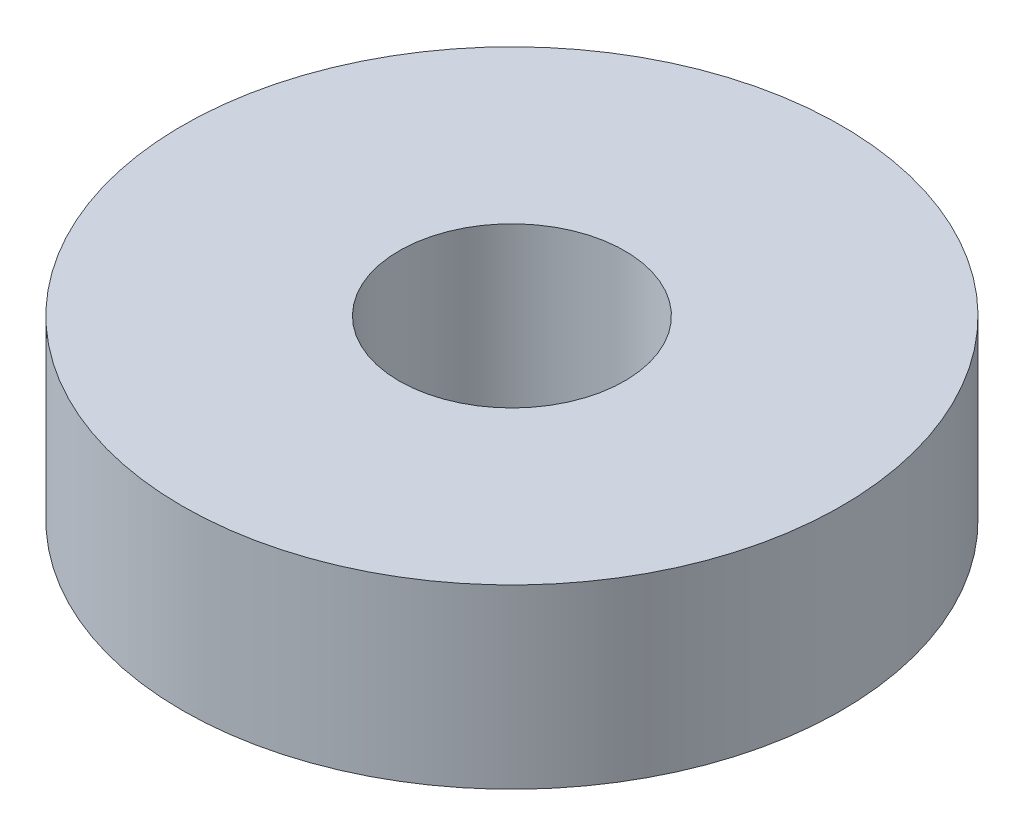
ISO-10303-21;
HEADER;
FILE_DESCRIPTION(('STEP AP214'),'2;1');
FILE_NAME('part.step','',(''),(''),'','','');
FILE_SCHEMA(('AUTOMOTIVE_DESIGN { 1 0 10303 214 1 1 1 1 }'));
ENDSEC;
DATA;
#1=APPLICATION_CONTEXT('core data for automotive mechanical design processes');
#2=APPLICATION_PROTOCOL_DEFINITION('international standard','automotive_design',2000,#1);
#3=PRODUCT_CONTEXT('',#1,'mechanical');
#4=PRODUCT('Part','Part','',(#3));
#5=PRODUCT_RELATED_PRODUCT_CATEGORY('part','',(#4));
#6=PRODUCT_DEFINITION_FORMATION('','',#4);
#7=PRODUCT_DEFINITION_CONTEXT('part definition',#1,'design');
#8=PRODUCT_DEFINITION('design','',#6,#7);
#9=PRODUCT_DEFINITION_SHAPE('','',#8);
#10=(LENGTH_UNIT() NAMED_UNIT(*) SI_UNIT(.MILLI.,.METRE.));
#11=(NAMED_UNIT(*) PLANE_ANGLE_UNIT() SI_UNIT($,.RADIAN.));
#12=(NAMED_UNIT(*) SI_UNIT($,.STERADIAN.) SOLID_ANGLE_UNIT());
#13=UNCERTAINTY_MEASURE_WITH_UNIT(LENGTH_MEASURE(1.E-05),#10,'distance_accuracy_value','');
#14=(GEOMETRIC_REPRESENTATION_CONTEXT(3) GLOBAL_UNCERTAINTY_ASSIGNED_CONTEXT((#13)) GLOBAL_UNIT_ASSIGNED_CONTEXT((#10,
#11,#12)) REPRESENTATION_CONTEXT('',''));
#15=CARTESIAN_POINT('',(0.,0.,0.));
#16=DIRECTION('',(0.,0.,1.));
#17=DIRECTION('',(1.,0.,0.));
#18=AXIS2_PLACEMENT_3D('',#15,#16,#17);
#19=CARTESIAN_POINT('',(0.,5.08,0.));
#20=DIRECTION('',(0.,1.,0.));
#21=DIRECTION('',(0.,0.,1.));
#22=AXIS2_PLACEMENT_3D('',#19,#20,#21);
#23=PLANE('',#22);
#24=CARTESIAN_POINT('',(0.,5.08,0.));
#25=DIRECTION('',(0.,1.,0.));
#26=DIRECTION('',(0.,0.,1.));
#27=AXIS2_PLACEMENT_3D('',#24,#25,#26);
#28=CIRCLE('',#27,9.4615);
#29=CARTESIAN_POINT('',(0.,5.08,9.4615));
#30=VERTEX_POINT('',#29);
#31=EDGE_CURVE('E10',#30,#30,#28,.T.);
#32=ORIENTED_EDGE('',*,*,#31,.T.);
#33=EDGE_LOOP('',(#32));
#34=FACE_BOUND('',#33,.T.);
#35=CARTESIAN_POINT('',(0.,5.08,0.));
#36=DIRECTION('',(0.,1.,0.));
#37=DIRECTION('',(0.,0.,1.));
#38=AXIS2_PLACEMENT_3D('',#35,#36,#37);
#39=CIRCLE('',#38,3.2385);
#40=CARTESIAN_POINT('',(0.,5.08,3.2385));
#41=VERTEX_POINT('',#40);
#42=EDGE_CURVE('E42',#41,#41,#39,.T.);
#43=ORIENTED_EDGE('',*,*,#42,.F.);
#44=EDGE_LOOP('',(#43));
#45=FACE_BOUND('',#44,.T.);
#46=ADVANCED_FACE('F31',(#34,#45),#23,.T.);
#47=CARTESIAN_POINT('',(0.,0.,0.));
#48=DIRECTION('',(0.,1.,0.));
#49=DIRECTION('',(0.,0.,1.));
#50=AXIS2_PLACEMENT_3D('',#47,#48,#49);
#51=PLANE('',#50);
#52=CARTESIAN_POINT('',(0.,0.,0.));
#53=DIRECTION('',(0.,1.,0.));
#54=DIRECTION('',(0.,0.,1.));
#55=AXIS2_PLACEMENT_3D('',#52,#53,#54);
#56=CIRCLE('',#55,9.4615);
#57=CARTESIAN_POINT('',(0.,0.,9.4615));
#58=VERTEX_POINT('',#57);
#59=EDGE_CURVE('E35',#58,#58,#56,.T.);
#60=ORIENTED_EDGE('',*,*,#59,.F.);
#61=EDGE_LOOP('',(#60));
#62=FACE_BOUND('',#61,.T.);
#63=CARTESIAN_POINT('',(0.,0.,0.));
#64=DIRECTION('',(0.,1.,0.));
#65=DIRECTION('',(0.,0.,1.));
#66=AXIS2_PLACEMENT_3D('',#63,#64,#65);
#67=CIRCLE('',#66,3.2385);
#68=CARTESIAN_POINT('',(0.,0.,3.2385));
#69=VERTEX_POINT('',#68);
#70=EDGE_CURVE('E44',#69,#69,#67,.T.);
#71=ORIENTED_EDGE('',*,*,#70,.T.);
#72=EDGE_LOOP('',(#71));
#73=FACE_BOUND('',#72,.T.);
#74=ADVANCED_FACE('F54',(#62,#73),#51,.F.);
#75=CARTESIAN_POINT('',(0.,5.08,0.));
#76=DIRECTION('',(0.,-1.,0.));
#77=DIRECTION('',(0.,0.,-1.));
#78=AXIS2_PLACEMENT_3D('',#75,#76,#77);
#79=CYLINDRICAL_SURFACE('',#78,9.4615);
#80=ORIENTED_EDGE('',*,*,#31,.F.);
#81=EDGE_LOOP('',(#80));
#82=FACE_BOUND('',#81,.T.);
#83=ORIENTED_EDGE('',*,*,#59,.T.);
#84=EDGE_LOOP('',(#83));
#85=FACE_BOUND('',#84,.T.);
#86=ADVANCED_FACE('F33',(#82,#85),#79,.T.);
#87=CARTESIAN_POINT('',(0.,5.08,0.));
#88=DIRECTION('',(0.,-1.,0.));
#89=DIRECTION('',(0.,0.,-1.));
#90=AXIS2_PLACEMENT_3D('',#87,#88,#89);
#91=CYLINDRICAL_SURFACE('',#90,3.2385);
#92=ORIENTED_EDGE('',*,*,#42,.T.);
#93=EDGE_LOOP('',(#92));
#94=FACE_BOUND('',#93,.T.);
#95=ORIENTED_EDGE('',*,*,#70,.F.);
#96=EDGE_LOOP('',(#95));
#97=FACE_BOUND('',#96,.T.);
#98=ADVANCED_FACE('F50',(#94,#97),#91,.F.);
#99=CLOSED_SHELL('',(#46,#74,#86,#98));
#100=MANIFOLD_SOLID_BREP('B2',#99);
#101=ADVANCED_BREP_SHAPE_REPRESENTATION('',(#18,#100),#14);
#102=SHAPE_DEFINITION_REPRESENTATION(#9,#101);
ENDSEC;
END-ISO-10303-21;
